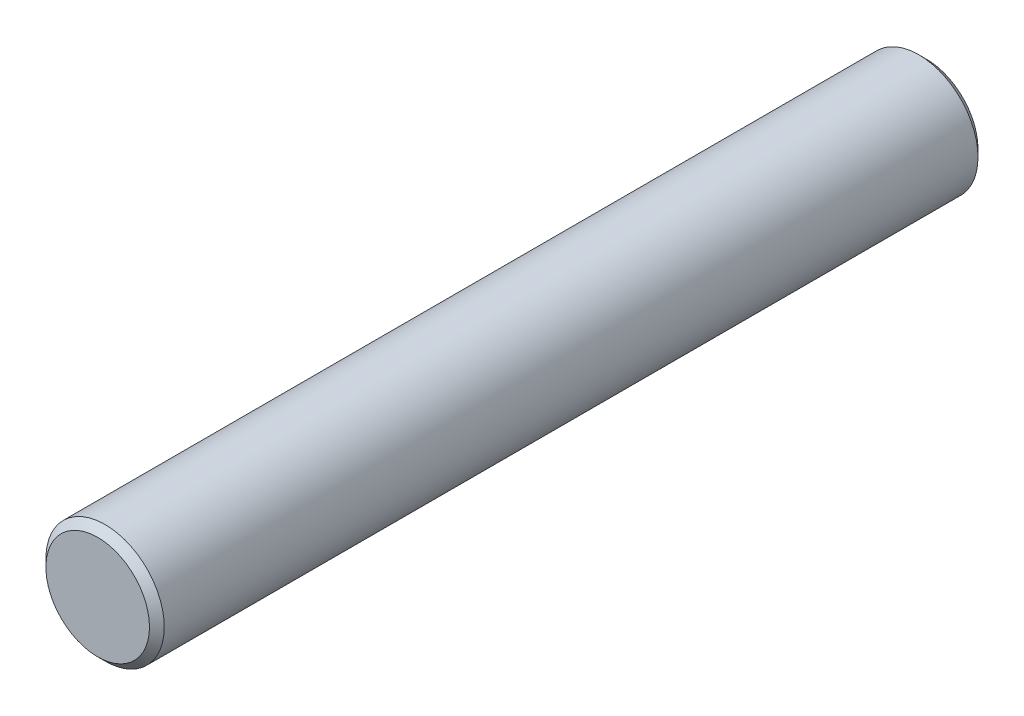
ISO-10303-21;
HEADER;
FILE_DESCRIPTION(('STEP AP214'),'2;1');
FILE_NAME('part.step','',(''),(''),'','','');
FILE_SCHEMA(('AUTOMOTIVE_DESIGN { 1 0 10303 214 1 1 1 1 }'));
ENDSEC;
DATA;
#1=APPLICATION_CONTEXT('core data for automotive mechanical design processes');
#2=APPLICATION_PROTOCOL_DEFINITION('international standard','automotive_design',2000,#1);
#3=PRODUCT_CONTEXT('',#1,'mechanical');
#4=PRODUCT('Part','Part','',(#3));
#5=PRODUCT_RELATED_PRODUCT_CATEGORY('part','',(#4));
#6=PRODUCT_DEFINITION_FORMATION('','',#4);
#7=PRODUCT_DEFINITION_CONTEXT('part definition',#1,'design');
#8=PRODUCT_DEFINITION('design','',#6,#7);
#9=PRODUCT_DEFINITION_SHAPE('','',#8);
#10=(LENGTH_UNIT() NAMED_UNIT(*) SI_UNIT(.MILLI.,.METRE.));
#11=(NAMED_UNIT(*) PLANE_ANGLE_UNIT() SI_UNIT($,.RADIAN.));
#12=(NAMED_UNIT(*) SI_UNIT($,.STERADIAN.) SOLID_ANGLE_UNIT());
#13=UNCERTAINTY_MEASURE_WITH_UNIT(LENGTH_MEASURE(1.E-05),#10,'distance_accuracy_value','');
#14=(GEOMETRIC_REPRESENTATION_CONTEXT(3) GLOBAL_UNCERTAINTY_ASSIGNED_CONTEXT((#13)) GLOBAL_UNIT_ASSIGNED_CONTEXT((#10,
#11,#12)) REPRESENTATION_CONTEXT('',''));
#15=CARTESIAN_POINT('',(0.,0.,0.));
#16=DIRECTION('',(0.,0.,1.));
#17=DIRECTION('',(1.,0.,0.));
#18=AXIS2_PLACEMENT_3D('',#15,#16,#17);
#19=CARTESIAN_POINT('',(0.,0.,28.));
#20=DIRECTION('',(0.,0.,-1.));
#21=DIRECTION('',(-1.,0.,0.));
#22=AXIS2_PLACEMENT_3D('',#19,#20,#21);
#23=CYLINDRICAL_SURFACE('',#22,2.);
#24=CARTESIAN_POINT('',(0.,0.,27.75));
#25=DIRECTION('',(0.,0.,1.));
#26=DIRECTION('',(1.,0.,0.));
#27=AXIS2_PLACEMENT_3D('',#24,#25,#26);
#28=CIRCLE('',#27,2.);
#29=CARTESIAN_POINT('',(2.,0.,27.75));
#30=VERTEX_POINT('',#29);
#31=EDGE_CURVE('E354',#30,#30,#28,.F.);
#32=ORIENTED_EDGE('',*,*,#31,.T.);
#33=EDGE_LOOP('',(#32));
#34=FACE_BOUND('',#33,.T.);
#35=CARTESIAN_POINT('',(0.,0.,0.25));
#36=DIRECTION('',(0.,0.,1.));
#37=DIRECTION('',(1.,0.,0.));
#38=AXIS2_PLACEMENT_3D('',#35,#36,#37);
#39=CIRCLE('',#38,2.);
#40=CARTESIAN_POINT('',(2.,0.,0.25));
#41=VERTEX_POINT('',#40);
#42=EDGE_CURVE('E358',#41,#41,#39,.T.);
#43=ORIENTED_EDGE('',*,*,#42,.T.);
#44=EDGE_LOOP('',(#43));
#45=FACE_BOUND('',#44,.T.);
#46=ADVANCED_FACE('F348',(#34,#45),#23,.T.);
#47=CARTESIAN_POINT('',(0.,0.,28.));
#48=DIRECTION('',(0.,0.,1.));
#49=DIRECTION('',(1.,0.,0.));
#50=AXIS2_PLACEMENT_3D('',#47,#48,#49);
#51=PLANE('',#50);
#52=CARTESIAN_POINT('',(0.,0.,28.));
#53=DIRECTION('',(0.,0.,1.));
#54=DIRECTION('',(1.,0.,0.));
#55=AXIS2_PLACEMENT_3D('',#52,#53,#54);
#56=CIRCLE('',#55,1.75);
#57=CARTESIAN_POINT('',(1.75,0.,28.));
#58=VERTEX_POINT('',#57);
#59=EDGE_CURVE('E362',#58,#58,#56,.T.);
#60=ORIENTED_EDGE('',*,*,#59,.T.);
#61=EDGE_LOOP('',(#60));
#62=FACE_BOUND('',#61,.T.);
#63=ADVANCED_FACE('F368',(#62),#51,.T.);
#64=CARTESIAN_POINT('',(0.,0.,0.));
#65=DIRECTION('',(0.,0.,1.));
#66=DIRECTION('',(1.,0.,0.));
#67=AXIS2_PLACEMENT_3D('',#64,#65,#66);
#68=PLANE('',#67);
#69=CARTESIAN_POINT('',(0.,0.,0.));
#70=DIRECTION('',(0.,0.,1.));
#71=DIRECTION('',(1.,0.,0.));
#72=AXIS2_PLACEMENT_3D('',#69,#70,#71);
#73=CIRCLE('',#72,1.75);
#74=CARTESIAN_POINT('',(1.75,0.,0.));
#75=VERTEX_POINT('',#74);
#76=EDGE_CURVE('E10',#75,#75,#73,.F.);
#77=ORIENTED_EDGE('',*,*,#76,.T.);
#78=EDGE_LOOP('',(#77));
#79=FACE_BOUND('',#78,.T.);
#80=ADVANCED_FACE('F373',(#79),#68,.F.);
#81=CARTESIAN_POINT('',(0.,0.,28.));
#82=DIRECTION('',(0.,0.,-1.));
#83=DIRECTION('',(-1.,0.,0.));
#84=AXIS2_PLACEMENT_3D('',#81,#82,#83);
#85=CONICAL_SURFACE('',#84,1.75,0.785398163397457);
#86=ORIENTED_EDGE('',*,*,#31,.F.);
#87=EDGE_LOOP('',(#86));
#88=FACE_BOUND('',#87,.T.);
#89=ORIENTED_EDGE('',*,*,#59,.F.);
#90=EDGE_LOOP('',(#89));
#91=FACE_BOUND('',#90,.T.);
#92=ADVANCED_FACE('F370',(#88,#91),#85,.T.);
#93=CARTESIAN_POINT('',(0.,0.,0.25));
#94=DIRECTION('',(0.,0.,1.));
#95=DIRECTION('',(1.,0.,0.));
#96=AXIS2_PLACEMENT_3D('',#93,#94,#95);
#97=CONICAL_SURFACE('',#96,2.,0.785398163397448);
#98=ORIENTED_EDGE('',*,*,#76,.F.);
#99=EDGE_LOOP('',(#98));
#100=FACE_BOUND('',#99,.T.);
#101=ORIENTED_EDGE('',*,*,#42,.F.);
#102=EDGE_LOOP('',(#101));
#103=FACE_BOUND('',#102,.T.);
#104=ADVANCED_FACE('F372',(#100,#103),#97,.T.);
#105=CLOSED_SHELL('',(#46,#63,#80,#92,#104));
#106=MANIFOLD_SOLID_BREP('B2',#105);
#107=ADVANCED_BREP_SHAPE_REPRESENTATION('',(#18,#106),#14);
#108=SHAPE_DEFINITION_REPRESENTATION(#9,#107);
ENDSEC;
END-ISO-10303-21;
